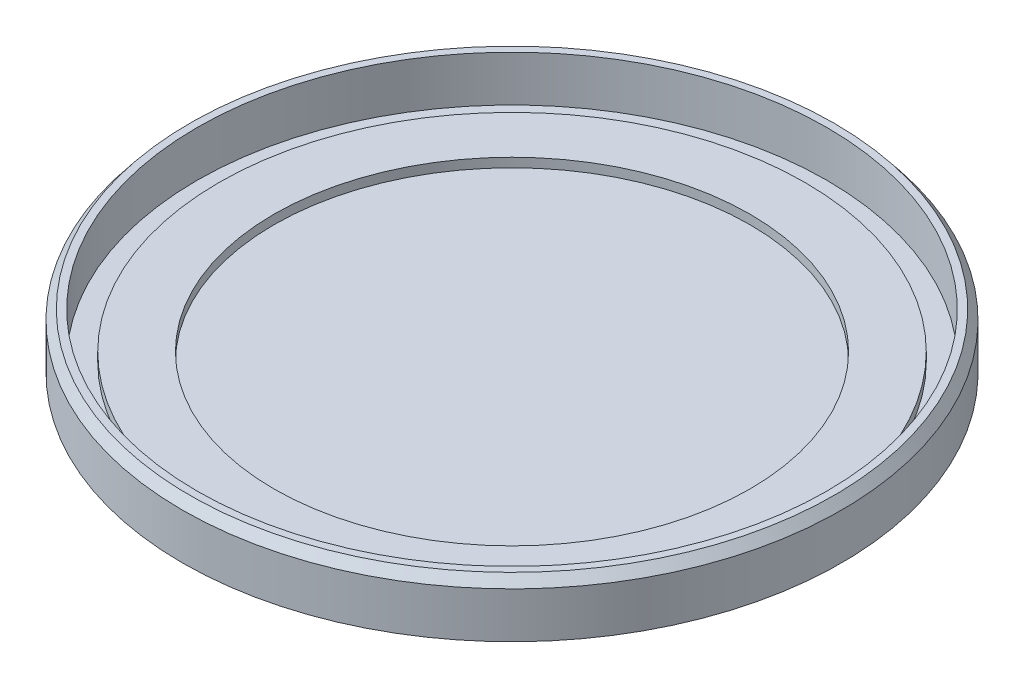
from build123d import *


with BuildPart() as part:
    # Sketch1 → Removable Drainage Saucer (revolve)
    with BuildSketch(Plane.XY, mode=Mode.PRIVATE) as removable_drainage_saucer_sk:
        Polygon((0, 0), (180, 0), (180, 25), (176, 30), (172, 30), (172, 5), (160, 5), (160, 10), (130, 10), (130, 5), (0, 5), align=None)
    revolve(removable_drainage_saucer_sk.sketch.rotate(Axis((0, -10, 0), (0, 1, 0)), 90), axis=Axis((0, -10, 0), (0, 1, 0)))


solid = part.part
